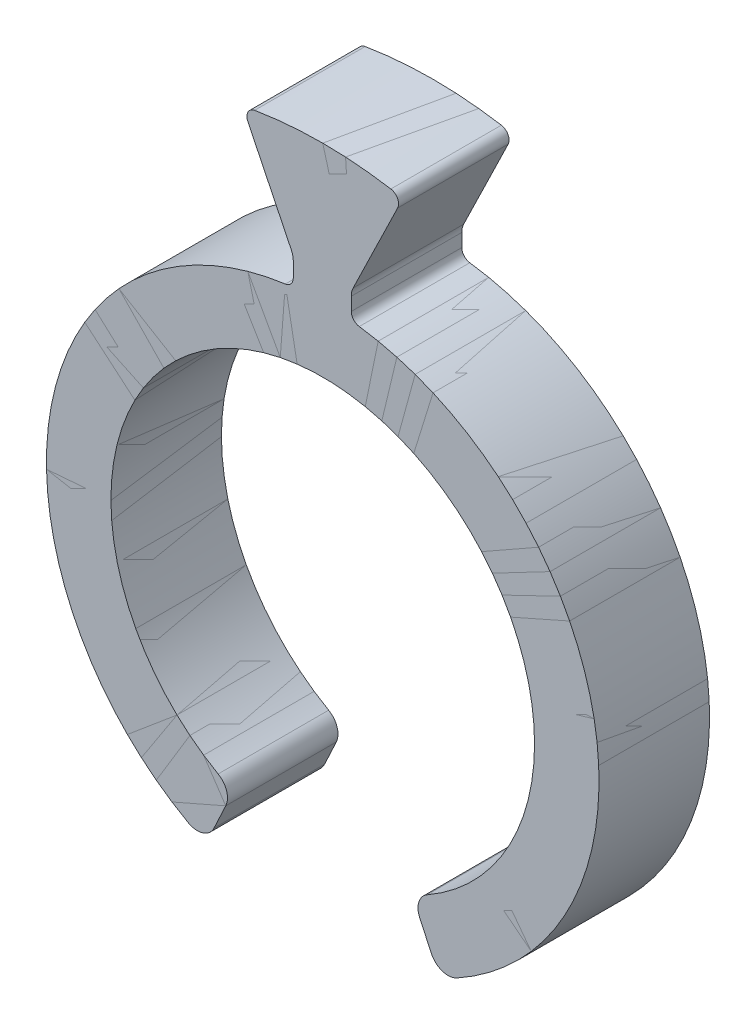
ISO-10303-21;
HEADER;
FILE_DESCRIPTION(('STEP AP214'),'2;1');
FILE_NAME('part.step','',(''),(''),'','','');
FILE_SCHEMA(('AUTOMOTIVE_DESIGN { 1 0 10303 214 1 1 1 1 }'));
ENDSEC;
DATA;
#1=APPLICATION_CONTEXT('core data for automotive mechanical design processes');
#2=APPLICATION_PROTOCOL_DEFINITION('international standard','automotive_design',2000,#1);
#3=PRODUCT_CONTEXT('',#1,'mechanical');
#4=PRODUCT('Part','Part','',(#3));
#5=PRODUCT_RELATED_PRODUCT_CATEGORY('part','',(#4));
#6=PRODUCT_DEFINITION_FORMATION('','',#4);
#7=PRODUCT_DEFINITION_CONTEXT('part definition',#1,'design');
#8=PRODUCT_DEFINITION('design','',#6,#7);
#9=PRODUCT_DEFINITION_SHAPE('','',#8);
#10=(LENGTH_UNIT() NAMED_UNIT(*) SI_UNIT(.MILLI.,.METRE.));
#11=(NAMED_UNIT(*) PLANE_ANGLE_UNIT() SI_UNIT($,.RADIAN.));
#12=(NAMED_UNIT(*) SI_UNIT($,.STERADIAN.) SOLID_ANGLE_UNIT());
#13=UNCERTAINTY_MEASURE_WITH_UNIT(LENGTH_MEASURE(1.E-05),#10,'distance_accuracy_value','');
#14=(GEOMETRIC_REPRESENTATION_CONTEXT(3) GLOBAL_UNCERTAINTY_ASSIGNED_CONTEXT((#13)) GLOBAL_UNIT_ASSIGNED_CONTEXT((#10,
#11,#12)) REPRESENTATION_CONTEXT('',''));
#15=CARTESIAN_POINT('',(0.,0.,0.));
#16=DIRECTION('',(0.,0.,1.));
#17=DIRECTION('',(1.,0.,0.));
#18=AXIS2_PLACEMENT_3D('',#15,#16,#17);
#19=CARTESIAN_POINT('',(8.83337144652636,-6.81471511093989,-3.));
#20=DIRECTION('',(0.,0.,-1.));
#21=DIRECTION('',(-1.,0.,0.));
#22=AXIS2_PLACEMENT_3D('',#19,#20,#21);
#23=PLANE('',#22);
#24=DIRECTION('',(0.43721847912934,0.899355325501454,0.));
#25=VECTOR('',#24,1.);
#26=CARTESIAN_POINT('',(1.48098888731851,9.60596693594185,-3.));
#27=LINE('',#26,#25);
#28=CARTESIAN_POINT('',(0.825161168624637,8.25693394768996,-3.));
#29=VERTEX_POINT('',#28);
#30=CARTESIAN_POINT('',(2.03282757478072,10.7410952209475,-3.));
#31=VERTEX_POINT('',#30);
#32=EDGE_CURVE('P0_E491',#29,#31,#27,.T.);
#33=ORIENTED_EDGE('',*,*,#32,.F.);
#34=CARTESIAN_POINT('',(1.2748388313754,8.0383247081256,-3.));
#35=DIRECTION('',(0.,0.,-1.));
#36=DIRECTION('',(-1.,0.,0.));
#37=AXIS2_PLACEMENT_3D('',#34,#35,#36);
#38=CIRCLE('',#37,0.500000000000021);
#39=CARTESIAN_POINT('',(0.774838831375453,8.03832470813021,-3.));
#40=VERTEX_POINT('',#39);
#41=EDGE_CURVE('P0_E354',#40,#29,#38,.T.);
#42=ORIENTED_EDGE('',*,*,#41,.F.);
#43=DIRECTION('',(1.83866593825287E-11,1.,0.));
#44=VECTOR('',#43,1.);
#45=CARTESIAN_POINT('',(0.77483883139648,9.1819402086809,-3.));
#46=LINE('',#45,#44);
#47=CARTESIAN_POINT('',(0.7748388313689,7.6819402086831,-3.));
#48=VERTEX_POINT('',#47);
#49=EDGE_CURVE('P0_E489',#48,#40,#46,.T.);
#50=ORIENTED_EDGE('',*,*,#49,.F.);
#51=CARTESIAN_POINT('',(1.0248388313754,7.6819402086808,-3.));
#52=DIRECTION('',(0.,0.,-1.));
#53=DIRECTION('',(-1.,0.,0.));
#54=AXIS2_PLACEMENT_3D('',#51,#52,#53);
#55=CIRCLE('',#54,0.250000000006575);
#56=CARTESIAN_POINT('',(0.991779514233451,7.43413568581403,-3.));
#57=VERTEX_POINT('',#56);
#58=EDGE_CURVE('P0_E504',#57,#48,#55,.T.);
#59=ORIENTED_EDGE('',*,*,#58,.F.);
#60=CARTESIAN_POINT('',(0.,0.,-3.));
#61=DIRECTION('',(0.,0.,1.));
#62=DIRECTION('',(1.,0.,0.));
#63=AXIS2_PLACEMENT_3D('',#60,#61,#62);
#64=CIRCLE('',#63,7.49999999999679);
#65=CARTESIAN_POINT('',(3.64706284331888,-6.55354351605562,-3.));
#66=VERTEX_POINT('',#65);
#67=EDGE_CURVE('P0_E582',#57,#66,#64,.F.);
#68=ORIENTED_EDGE('',*,*,#67,.T.);
#69=CARTESIAN_POINT('',(3.4039253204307,-6.1166406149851,-3.));
#70=DIRECTION('',(0.,0.,1.));
#71=DIRECTION('',(1.,0.,0.));
#72=AXIS2_PLACEMENT_3D('',#69,#70,#71);
#73=CIRCLE('',#72,0.500000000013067);
#74=CARTESIAN_POINT('',(2.95077142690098,-6.32794974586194,-3.));
#75=VERTEX_POINT('',#74);
#76=EDGE_CURVE('P0_E512',#66,#75,#73,.F.);
#77=ORIENTED_EDGE('',*,*,#76,.T.);
#78=DIRECTION('',(0.422618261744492,-0.906307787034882,0.));
#79=VECTOR('',#78,1.);
#80=CARTESIAN_POINT('',(3.26682559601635,-7.00573009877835,-3.));
#81=LINE('',#80,#79);
#82=CARTESIAN_POINT('',(2.63289820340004,-5.64626841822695,-3.));
#83=VERTEX_POINT('',#82);
#84=EDGE_CURVE('P0_E509',#83,#75,#81,.T.);
#85=ORIENTED_EDGE('',*,*,#84,.F.);
#86=CARTESIAN_POINT('',(3.0860520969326,-5.4349592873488,-3.));
#87=DIRECTION('',(0.,0.,1.));
#88=DIRECTION('',(1.,0.,0.));
#89=AXIS2_PLACEMENT_3D('',#86,#87,#88);
#90=CIRCLE('',#89,0.50000000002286);
#91=CARTESIAN_POINT('',(2.83916792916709,-5.00016254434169,-3.));
#92=VERTEX_POINT('',#91);
#93=EDGE_CURVE('P0_E587',#83,#92,#90,.F.);
#94=ORIENTED_EDGE('',*,*,#93,.T.);
#95=CARTESIAN_POINT('',(0.,0.,-3.));
#96=DIRECTION('',(0.,0.,-1.));
#97=DIRECTION('',(-1.,0.,0.));
#98=AXIS2_PLACEMENT_3D('',#95,#96,#97);
#99=CIRCLE('',#98,5.7499999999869);
#100=CARTESIAN_POINT('',(-2.83916792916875,-5.00016254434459,-3.));
#101=VERTEX_POINT('',#100);
#102=EDGE_CURVE('P0_E590',#101,#92,#99,.T.);
#103=ORIENTED_EDGE('',*,*,#102,.F.);
#104=CARTESIAN_POINT('',(-3.0860520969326,-5.4349592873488,-3.));
#105=DIRECTION('',(0.,0.,1.));
#106=DIRECTION('',(1.,0.,0.));
#107=AXIS2_PLACEMENT_3D('',#104,#105,#106);
#108=CIRCLE('',#107,0.50000000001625);
#109=CARTESIAN_POINT('',(-2.6328982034,-5.64626841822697,-3.));
#110=VERTEX_POINT('',#109);
#111=EDGE_CURVE('P0_E517',#101,#110,#108,.F.);
#112=ORIENTED_EDGE('',*,*,#111,.T.);
#113=DIRECTION('',(0.422618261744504,0.906307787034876,0.));
#114=VECTOR('',#113,1.);
#115=CARTESIAN_POINT('',(-2.31684403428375,-4.9684880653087,-3.));
#116=LINE('',#115,#114);
#117=CARTESIAN_POINT('',(-2.95077142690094,-6.32794974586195,-3.));
#118=VERTEX_POINT('',#117);
#119=EDGE_CURVE('P0_E514',#118,#110,#116,.T.);
#120=ORIENTED_EDGE('',*,*,#119,.F.);
#121=CARTESIAN_POINT('',(-3.4039253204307,-6.1166406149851,-3.));
#122=DIRECTION('',(0.,0.,1.));
#123=DIRECTION('',(1.,0.,0.));
#124=AXIS2_PLACEMENT_3D('',#121,#122,#123);
#125=CIRCLE('',#124,0.500000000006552);
#126=CARTESIAN_POINT('',(-3.6470628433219,-6.55354351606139,-3.));
#127=VERTEX_POINT('',#126);
#128=EDGE_CURVE('P0_E596',#118,#127,#125,.F.);
#129=ORIENTED_EDGE('',*,*,#128,.T.);
#130=CARTESIAN_POINT('',(0.,0.,-3.));
#131=DIRECTION('',(0.,0.,1.));
#132=DIRECTION('',(1.,0.,0.));
#133=AXIS2_PLACEMENT_3D('',#130,#131,#132);
#134=CIRCLE('',#133,7.49999999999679);
#135=CARTESIAN_POINT('',(-1.01612903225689,7.43084664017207,-3.));
#136=VERTEX_POINT('',#135);
#137=EDGE_CURVE('P0_E600',#127,#136,#134,.F.);
#138=ORIENTED_EDGE('',*,*,#137,.T.);
#139=CARTESIAN_POINT('',(-1.0499999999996,7.6785415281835,-3.));
#140=DIRECTION('',(0.,0.,-1.));
#141=DIRECTION('',(-1.,0.,0.));
#142=AXIS2_PLACEMENT_3D('',#139,#140,#141);
#143=CIRCLE('',#142,0.250000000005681);
#144=CARTESIAN_POINT('',(-0.799999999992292,7.67854152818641,-3.));
#145=VERTEX_POINT('',#144);
#146=EDGE_CURVE('P0_E602',#145,#136,#143,.T.);
#147=ORIENTED_EDGE('',*,*,#146,.F.);
#148=DIRECTION('',(2.24633318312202E-11,-1.,0.));
#149=VECTOR('',#148,1.);
#150=CARTESIAN_POINT('',(-0.799999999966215,6.5900810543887,-3.));
#151=LINE('',#150,#149);
#152=CARTESIAN_POINT('',(-0.79999999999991,8.09008105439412,-3.));
#153=VERTEX_POINT('',#152);
#154=EDGE_CURVE('P0_E519',#153,#145,#151,.T.);
#155=ORIENTED_EDGE('',*,*,#154,.F.);
#156=CARTESIAN_POINT('',(-1.2999999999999,8.0900810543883,-3.));
#157=DIRECTION('',(0.,0.,-1.));
#158=DIRECTION('',(-1.,0.,0.));
#159=AXIS2_PLACEMENT_3D('',#156,#157,#158);
#160=CIRCLE('',#159,0.499999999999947);
#161=CARTESIAN_POINT('',(-0.850322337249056,8.30869029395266,-3.));
#162=VERTEX_POINT('',#161);
#163=EDGE_CURVE('P0_E605',#162,#153,#160,.T.);
#164=ORIENTED_EDGE('',*,*,#163,.F.);
#165=DIRECTION('',(0.437218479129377,-0.899355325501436,0.));
#166=VECTOR('',#165,1.);
#167=CARTESIAN_POINT('',(-1.37699985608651,9.392062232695,-3.));
#168=LINE('',#167,#166);
#169=CARTESIAN_POINT('',(-2.03282757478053,10.7410952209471,-3.));
#170=VERTEX_POINT('',#169);
#171=EDGE_CURVE('P0_E523',#170,#162,#168,.T.);
#172=ORIENTED_EDGE('',*,*,#171,.F.);
#173=CARTESIAN_POINT('',(-1.8079887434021,10.850399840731,-3.));
#174=DIRECTION('',(0.,0.,1.));
#175=DIRECTION('',(1.,0.,0.));
#176=AXIS2_PLACEMENT_3D('',#173,#174,#175);
#177=CIRCLE('',#176,0.250000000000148);
#178=CARTESIAN_POINT('',(-1.84907939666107,11.0969998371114,-3.));
#179=VERTEX_POINT('',#178);
#180=EDGE_CURVE('P0_E607',#170,#179,#177,.F.);
#181=ORIENTED_EDGE('',*,*,#180,.T.);
#182=CARTESIAN_POINT('',(0.,0.,-3.));
#183=DIRECTION('',(0.,0.,1.));
#184=DIRECTION('',(1.,0.,0.));
#185=AXIS2_PLACEMENT_3D('',#182,#183,#184);
#186=CIRCLE('',#185,11.25);
#187=CARTESIAN_POINT('',(1.84907875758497,11.0969999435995,-3.));
#188=VERTEX_POINT('',#187);
#189=EDGE_CURVE('P0_E611',#179,#188,#186,.F.);
#190=ORIENTED_EDGE('',*,*,#189,.T.);
#191=CARTESIAN_POINT('',(1.8079887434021,10.850399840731,-3.));
#192=DIRECTION('',(0.,0.,1.));
#193=DIRECTION('',(1.,0.,0.));
#194=AXIS2_PLACEMENT_3D('',#191,#192,#193);
#195=CIRCLE('',#194,0.250000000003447);
#196=EDGE_CURVE('P0_E528',#188,#31,#195,.F.);
#197=ORIENTED_EDGE('',*,*,#196,.T.);
#198=EDGE_LOOP('',(#33,#42,#50,#59,#68,#77,#85,#94,#103,#112,#120,#129,#138,#147,#155,#164,#172,
#181,#190,#197));
#199=FACE_BOUND('',#198,.T.);
#200=ADVANCED_FACE('P0_F350',(#199),#23,.T.);
#201=CARTESIAN_POINT('',(1.2748388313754,8.0383247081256,0.));
#202=DIRECTION('',(0.,0.,-1.));
#203=DIRECTION('',(-1.,0.,0.));
#204=AXIS2_PLACEMENT_3D('',#201,#202,#203);
#205=CYLINDRICAL_SURFACE('',#204,0.500000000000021);
#206=ORIENTED_EDGE('',*,*,#41,.T.);
#207=DIRECTION('',(0.,0.,-1.));
#208=VECTOR('',#207,1.);
#209=CARTESIAN_POINT('',(0.82516116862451,8.2569339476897,-1.5));
#210=LINE('',#209,#208);
#211=CARTESIAN_POINT('',(0.825161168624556,8.25693394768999,0.));
#212=VERTEX_POINT('',#211);
#213=EDGE_CURVE('P0_E494',#212,#29,#210,.T.);
#214=ORIENTED_EDGE('',*,*,#213,.F.);
#215=CARTESIAN_POINT('',(1.2748388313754,8.0383247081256,0.));
#216=DIRECTION('',(0.,0.,-1.));
#217=DIRECTION('',(-1.,0.,0.));
#218=AXIS2_PLACEMENT_3D('',#215,#216,#217);
#219=CIRCLE('',#218,0.500000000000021);
#220=CARTESIAN_POINT('',(0.774838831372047,8.03832470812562,0.));
#221=VERTEX_POINT('',#220);
#222=EDGE_CURVE('P0_E499',#221,#212,#219,.T.);
#223=ORIENTED_EDGE('',*,*,#222,.F.);
#224=DIRECTION('',(0.,0.,1.));
#225=VECTOR('',#224,1.);
#226=CARTESIAN_POINT('',(0.774838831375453,8.03832470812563,-1.5));
#227=LINE('',#226,#225);
#228=EDGE_CURVE('P0_E496',#40,#221,#227,.T.);
#229=ORIENTED_EDGE('',*,*,#228,.F.);
#230=EDGE_LOOP('',(#206,#214,#223,#229));
#231=FACE_BOUND('',#230,.T.);
#232=ADVANCED_FACE('P0_F497',(#231),#205,.F.);
#233=CARTESIAN_POINT('',(0.82516116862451,8.2569339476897,0.));
#234=DIRECTION('',(0.899355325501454,-0.43721847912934,0.));
#235=DIRECTION('',(0.,0.,-1.));
#236=AXIS2_PLACEMENT_3D('',#233,#234,#235);
#237=PLANE('',#236);
#238=ORIENTED_EDGE('',*,*,#32,.T.);
#239=DIRECTION('',(0.,0.,1.));
#240=VECTOR('',#239,1.);
#241=CARTESIAN_POINT('',(2.03282757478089,10.7410952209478,-1.5));
#242=LINE('',#241,#240);
#243=CARTESIAN_POINT('',(2.03282757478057,10.7410952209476,0.));
#244=VERTEX_POINT('',#243);
#245=EDGE_CURVE('P0_E612',#31,#244,#242,.T.);
#246=ORIENTED_EDGE('',*,*,#245,.T.);
#247=DIRECTION('',(0.437218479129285,0.899355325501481,0.));
#248=VECTOR('',#247,1.);
#249=CARTESIAN_POINT('',(0.825161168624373,8.2569339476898,0.));
#250=LINE('',#249,#248);
#251=EDGE_CURVE('P0_E576',#212,#244,#250,.T.);
#252=ORIENTED_EDGE('',*,*,#251,.F.);
#253=ORIENTED_EDGE('',*,*,#213,.T.);
#254=EDGE_LOOP('',(#238,#246,#252,#253));
#255=FACE_BOUND('',#254,.T.);
#256=ADVANCED_FACE('P0_F694',(#255),#237,.T.);
#257=CARTESIAN_POINT('',(1.8079887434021,10.850399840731,-3.));
#258=DIRECTION('',(0.,0.,1.));
#259=DIRECTION('',(1.,0.,0.));
#260=AXIS2_PLACEMENT_3D('',#257,#258,#259);
#261=CYLINDRICAL_SURFACE('',#260,0.250000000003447);
#262=ORIENTED_EDGE('',*,*,#245,.F.);
#263=ORIENTED_EDGE('',*,*,#196,.F.);
#264=DIRECTION('',(0.,0.,1.));
#265=VECTOR('',#264,1.);
#266=CARTESIAN_POINT('',(1.84907811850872,11.097000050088,-1.5));
#267=LINE('',#266,#265);
#268=CARTESIAN_POINT('',(1.84907875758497,11.0969999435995,0.));
#269=VERTEX_POINT('',#268);
#270=EDGE_CURVE('P0_E610',#188,#269,#267,.T.);
#271=ORIENTED_EDGE('',*,*,#270,.T.);
#272=CARTESIAN_POINT('',(1.8079887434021,10.850399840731,0.));
#273=DIRECTION('',(0.,0.,1.));
#274=DIRECTION('',(1.,0.,0.));
#275=AXIS2_PLACEMENT_3D('',#272,#273,#274);
#276=CIRCLE('',#275,0.250000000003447);
#277=EDGE_CURVE('P0_E573',#244,#269,#276,.T.);
#278=ORIENTED_EDGE('',*,*,#277,.F.);
#279=EDGE_LOOP('',(#262,#263,#271,#278));
#280=FACE_BOUND('',#279,.T.);
#281=ADVANCED_FACE('P0_F696',(#280),#261,.T.);
#282=CARTESIAN_POINT('',(0.,0.,-3.));
#283=DIRECTION('',(0.,0.,1.));
#284=DIRECTION('',(1.,0.,0.));
#285=AXIS2_PLACEMENT_3D('',#282,#283,#284);
#286=CYLINDRICAL_SURFACE('',#285,11.25);
#287=ORIENTED_EDGE('',*,*,#270,.F.);
#288=ORIENTED_EDGE('',*,*,#189,.F.);
#289=DIRECTION('',(0.,0.,1.));
#290=VECTOR('',#289,1.);
#291=CARTESIAN_POINT('',(-1.84907939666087,11.0969998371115,-1.5));
#292=LINE('',#291,#290);
#293=CARTESIAN_POINT('',(-1.84907939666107,11.0969998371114,0.));
#294=VERTEX_POINT('',#293);
#295=EDGE_CURVE('P0_E609',#179,#294,#292,.T.);
#296=ORIENTED_EDGE('',*,*,#295,.T.);
#297=CARTESIAN_POINT('',(0.,0.,0.));
#298=DIRECTION('',(0.,0.,1.));
#299=DIRECTION('',(1.,0.,0.));
#300=AXIS2_PLACEMENT_3D('',#297,#298,#299);
#301=CIRCLE('',#300,11.25);
#302=EDGE_CURVE('P0_E570',#269,#294,#301,.T.);
#303=ORIENTED_EDGE('',*,*,#302,.F.);
#304=EDGE_LOOP('',(#287,#288,#296,#303));
#305=FACE_BOUND('',#304,.T.);
#306=ADVANCED_FACE('P0_F701',(#305),#286,.T.);
#307=CARTESIAN_POINT('',(-1.8079887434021,10.850399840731,-3.));
#308=DIRECTION('',(0.,0.,1.));
#309=DIRECTION('',(1.,0.,0.));
#310=AXIS2_PLACEMENT_3D('',#307,#308,#309);
#311=CYLINDRICAL_SURFACE('',#310,0.250000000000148);
#312=ORIENTED_EDGE('',*,*,#295,.F.);
#313=ORIENTED_EDGE('',*,*,#180,.F.);
#314=DIRECTION('',(0.,0.,-1.));
#315=VECTOR('',#314,1.);
#316=CARTESIAN_POINT('',(-2.0328275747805,10.741095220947,-1.5));
#317=LINE('',#316,#315);
#318=CARTESIAN_POINT('',(-2.03282757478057,10.7410952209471,0.));
#319=VERTEX_POINT('',#318);
#320=EDGE_CURVE('P0_E526',#319,#170,#317,.T.);
#321=ORIENTED_EDGE('',*,*,#320,.F.);
#322=CARTESIAN_POINT('',(-1.8079887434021,10.850399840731,0.));
#323=DIRECTION('',(0.,0.,1.));
#324=DIRECTION('',(1.,0.,0.));
#325=AXIS2_PLACEMENT_3D('',#322,#323,#324);
#326=CIRCLE('',#325,0.250000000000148);
#327=EDGE_CURVE('P0_E567',#294,#319,#326,.T.);
#328=ORIENTED_EDGE('',*,*,#327,.F.);
#329=EDGE_LOOP('',(#312,#313,#321,#328));
#330=FACE_BOUND('',#329,.T.);
#331=ADVANCED_FACE('P0_F706',(#330),#311,.T.);
#332=CARTESIAN_POINT('',(-2.0328275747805,10.741095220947,0.));
#333=DIRECTION('',(-0.899355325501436,-0.437218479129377,0.));
#334=DIRECTION('',(0.,0.,-1.));
#335=AXIS2_PLACEMENT_3D('',#332,#333,#334);
#336=PLANE('',#335);
#337=ORIENTED_EDGE('',*,*,#171,.T.);
#338=DIRECTION('',(0.,0.,-1.));
#339=VECTOR('',#338,1.);
#340=CARTESIAN_POINT('',(-0.850322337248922,8.30869029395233,-1.5));
#341=LINE('',#340,#339);
#342=CARTESIAN_POINT('',(-0.850322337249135,8.30869029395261,0.));
#343=VERTEX_POINT('',#342);
#344=EDGE_CURVE('P0_E525',#343,#162,#341,.T.);
#345=ORIENTED_EDGE('',*,*,#344,.F.);
#346=DIRECTION('',(0.437218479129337,-0.899355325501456,0.));
#347=VECTOR('',#346,1.);
#348=CARTESIAN_POINT('',(-2.03282757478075,10.7410952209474,0.));
#349=LINE('',#348,#347);
#350=EDGE_CURVE('P0_E564',#319,#343,#349,.T.);
#351=ORIENTED_EDGE('',*,*,#350,.F.);
#352=ORIENTED_EDGE('',*,*,#320,.T.);
#353=EDGE_LOOP('',(#337,#345,#351,#352));
#354=FACE_BOUND('',#353,.T.);
#355=ADVANCED_FACE('P0_F709',(#354),#336,.T.);
#356=CARTESIAN_POINT('',(-1.2999999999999,8.0900810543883,0.));
#357=DIRECTION('',(0.,0.,-1.));
#358=DIRECTION('',(-1.,0.,0.));
#359=AXIS2_PLACEMENT_3D('',#356,#357,#358);
#360=CYLINDRICAL_SURFACE('',#359,0.499999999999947);
#361=ORIENTED_EDGE('',*,*,#163,.T.);
#362=DIRECTION('',(0.,0.,-1.));
#363=VECTOR('',#362,1.);
#364=CARTESIAN_POINT('',(-0.79999999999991,8.0900810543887,-1.5));
#365=LINE('',#364,#363);
#366=CARTESIAN_POINT('',(-0.799999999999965,8.0900810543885,0.));
#367=VERTEX_POINT('',#366);
#368=EDGE_CURVE('P0_E522',#367,#153,#365,.T.);
#369=ORIENTED_EDGE('',*,*,#368,.F.);
#370=CARTESIAN_POINT('',(-1.2999999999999,8.0900810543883,0.));
#371=DIRECTION('',(0.,0.,-1.));
#372=DIRECTION('',(-1.,0.,0.));
#373=AXIS2_PLACEMENT_3D('',#370,#371,#372);
#374=CIRCLE('',#373,0.499999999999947);
#375=EDGE_CURVE('P0_E561',#343,#367,#374,.T.);
#376=ORIENTED_EDGE('',*,*,#375,.F.);
#377=ORIENTED_EDGE('',*,*,#344,.T.);
#378=EDGE_LOOP('',(#361,#369,#376,#377));
#379=FACE_BOUND('',#378,.T.);
#380=ADVANCED_FACE('P0_F712',(#379),#360,.F.);
#381=CARTESIAN_POINT('',(-0.79999999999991,8.0900810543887,0.));
#382=DIRECTION('',(-1.,-2.24633318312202E-11,0.));
#383=DIRECTION('',(0.,0.,-1.));
#384=AXIS2_PLACEMENT_3D('',#381,#382,#383);
#385=PLANE('',#384);
#386=ORIENTED_EDGE('',*,*,#154,.T.);
#387=DIRECTION('',(0.,0.,-1.));
#388=VECTOR('',#387,1.);
#389=CARTESIAN_POINT('',(-0.799999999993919,7.67854152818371,-1.5));
#390=LINE('',#389,#388);
#391=CARTESIAN_POINT('',(-0.79999999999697,7.67854152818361,0.));
#392=VERTEX_POINT('',#391);
#393=EDGE_CURVE('P0_E521',#392,#145,#390,.T.);
#394=ORIENTED_EDGE('',*,*,#393,.F.);
#395=DIRECTION('',(0.,-1.,0.));
#396=VECTOR('',#395,1.);
#397=CARTESIAN_POINT('',(-0.80000000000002,2.30697564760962,0.));
#398=LINE('',#397,#396);
#399=EDGE_CURVE('P0_E560',#367,#392,#398,.T.);
#400=ORIENTED_EDGE('',*,*,#399,.F.);
#401=ORIENTED_EDGE('',*,*,#368,.T.);
#402=EDGE_LOOP('',(#386,#394,#400,#401));
#403=FACE_BOUND('',#402,.T.);
#404=ADVANCED_FACE('P0_F649',(#403),#385,.T.);
#405=CARTESIAN_POINT('',(-1.0499999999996,7.6785415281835,0.));
#406=DIRECTION('',(0.,0.,-1.));
#407=DIRECTION('',(-1.,0.,0.));
#408=AXIS2_PLACEMENT_3D('',#405,#406,#407);
#409=CYLINDRICAL_SURFACE('',#408,0.250000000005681);
#410=ORIENTED_EDGE('',*,*,#146,.T.);
#411=DIRECTION('',(0.,0.,1.));
#412=VECTOR('',#411,1.);
#413=CARTESIAN_POINT('',(-1.01612903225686,7.43084664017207,-1.5));
#414=LINE('',#413,#412);
#415=CARTESIAN_POINT('',(-1.01612903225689,7.43084664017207,0.));
#416=VERTEX_POINT('',#415);
#417=EDGE_CURVE('P0_E599',#136,#416,#414,.T.);
#418=ORIENTED_EDGE('',*,*,#417,.T.);
#419=CARTESIAN_POINT('',(-1.0499999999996,7.6785415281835,0.));
#420=DIRECTION('',(0.,0.,-1.));
#421=DIRECTION('',(-1.,0.,0.));
#422=AXIS2_PLACEMENT_3D('',#419,#420,#421);
#423=CIRCLE('',#422,0.250000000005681);
#424=EDGE_CURVE('P0_E557',#392,#416,#423,.T.);
#425=ORIENTED_EDGE('',*,*,#424,.F.);
#426=ORIENTED_EDGE('',*,*,#393,.T.);
#427=EDGE_LOOP('',(#410,#418,#425,#426));
#428=FACE_BOUND('',#427,.T.);
#429=ADVANCED_FACE('P0_F653',(#428),#409,.F.);
#430=CARTESIAN_POINT('',(0.,0.,-3.));
#431=DIRECTION('',(0.,0.,1.));
#432=DIRECTION('',(1.,0.,0.));
#433=AXIS2_PLACEMENT_3D('',#430,#431,#432);
#434=CYLINDRICAL_SURFACE('',#433,7.49999999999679);
#435=ORIENTED_EDGE('',*,*,#417,.F.);
#436=ORIENTED_EDGE('',*,*,#137,.F.);
#437=DIRECTION('',(0.,0.,1.));
#438=VECTOR('',#437,1.);
#439=CARTESIAN_POINT('',(-3.6470628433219,-6.5535435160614,-1.5));
#440=LINE('',#439,#438);
#441=CARTESIAN_POINT('',(-3.6470628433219,-6.55354351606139,0.));
#442=VERTEX_POINT('',#441);
#443=EDGE_CURVE('P0_E598',#127,#442,#440,.T.);
#444=ORIENTED_EDGE('',*,*,#443,.T.);
#445=CARTESIAN_POINT('',(0.,0.,0.));
#446=DIRECTION('',(0.,0.,1.));
#447=DIRECTION('',(1.,0.,0.));
#448=AXIS2_PLACEMENT_3D('',#445,#446,#447);
#449=CIRCLE('',#448,7.49999999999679);
#450=EDGE_CURVE('P0_E554',#416,#442,#449,.T.);
#451=ORIENTED_EDGE('',*,*,#450,.F.);
#452=EDGE_LOOP('',(#435,#436,#444,#451));
#453=FACE_BOUND('',#452,.T.);
#454=ADVANCED_FACE('P0_F658',(#453),#434,.T.);
#455=CARTESIAN_POINT('',(-3.4039253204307,-6.1166406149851,-3.));
#456=DIRECTION('',(0.,0.,1.));
#457=DIRECTION('',(1.,0.,0.));
#458=AXIS2_PLACEMENT_3D('',#455,#456,#457);
#459=CYLINDRICAL_SURFACE('',#458,0.500000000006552);
#460=ORIENTED_EDGE('',*,*,#443,.F.);
#461=ORIENTED_EDGE('',*,*,#128,.F.);
#462=DIRECTION('',(0.,0.,-1.));
#463=VECTOR('',#462,1.);
#464=CARTESIAN_POINT('',(-2.9507714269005,-6.327949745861,-1.5));
#465=LINE('',#464,#463);
#466=CARTESIAN_POINT('',(-2.95077142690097,-6.32794974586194,0.));
#467=VERTEX_POINT('',#466);
#468=EDGE_CURVE('P0_E518',#467,#118,#465,.T.);
#469=ORIENTED_EDGE('',*,*,#468,.F.);
#470=CARTESIAN_POINT('',(-3.4039253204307,-6.1166406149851,0.));
#471=DIRECTION('',(0.,0.,1.));
#472=DIRECTION('',(1.,0.,0.));
#473=AXIS2_PLACEMENT_3D('',#470,#471,#472);
#474=CIRCLE('',#473,0.500000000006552);
#475=EDGE_CURVE('P0_E551',#442,#467,#474,.T.);
#476=ORIENTED_EDGE('',*,*,#475,.F.);
#477=EDGE_LOOP('',(#460,#461,#469,#476));
#478=FACE_BOUND('',#477,.T.);
#479=ADVANCED_FACE('P0_F663',(#478),#459,.T.);
#480=CARTESIAN_POINT('',(-2.9507714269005,-6.327949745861,0.));
#481=DIRECTION('',(0.906307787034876,-0.422618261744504,0.));
#482=DIRECTION('',(0.,0.,-1.));
#483=AXIS2_PLACEMENT_3D('',#480,#481,#482);
#484=PLANE('',#483);
#485=ORIENTED_EDGE('',*,*,#119,.T.);
#486=DIRECTION('',(0.,0.,1.));
#487=VECTOR('',#486,1.);
#488=CARTESIAN_POINT('',(-2.63289820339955,-5.64626841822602,-1.5));
#489=LINE('',#488,#487);
#490=CARTESIAN_POINT('',(-2.63289820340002,-5.64626841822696,0.));
#491=VERTEX_POINT('',#490);
#492=EDGE_CURVE('P0_E595',#110,#491,#489,.T.);
#493=ORIENTED_EDGE('',*,*,#492,.T.);
#494=DIRECTION('',(0.422618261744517,0.90630778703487,0.));
#495=VECTOR('',#494,1.);
#496=CARTESIAN_POINT('',(-2.9507714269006,-6.32794974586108,0.));
#497=LINE('',#496,#495);
#498=EDGE_CURVE('P0_E548',#467,#491,#497,.T.);
#499=ORIENTED_EDGE('',*,*,#498,.F.);
#500=ORIENTED_EDGE('',*,*,#468,.T.);
#501=EDGE_LOOP('',(#485,#493,#499,#500));
#502=FACE_BOUND('',#501,.T.);
#503=ADVANCED_FACE('P0_F666',(#502),#484,.T.);
#504=CARTESIAN_POINT('',(-3.0860520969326,-5.4349592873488,-3.));
#505=DIRECTION('',(0.,0.,1.));
#506=DIRECTION('',(1.,0.,0.));
#507=AXIS2_PLACEMENT_3D('',#504,#505,#506);
#508=CYLINDRICAL_SURFACE('',#507,0.50000000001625);
#509=ORIENTED_EDGE('',*,*,#492,.F.);
#510=ORIENTED_EDGE('',*,*,#111,.F.);
#511=DIRECTION('',(0.,0.,-1.));
#512=VECTOR('',#511,1.);
#513=CARTESIAN_POINT('',(-2.83916792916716,-5.00016254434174,-1.5));
#514=LINE('',#513,#512);
#515=CARTESIAN_POINT('',(-2.83916792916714,-5.00016254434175,0.));
#516=VERTEX_POINT('',#515);
#517=EDGE_CURVE('P0_E593',#516,#101,#514,.T.);
#518=ORIENTED_EDGE('',*,*,#517,.F.);
#519=CARTESIAN_POINT('',(-3.0860520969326,-5.4349592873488,0.));
#520=DIRECTION('',(0.,0.,1.));
#521=DIRECTION('',(1.,0.,0.));
#522=AXIS2_PLACEMENT_3D('',#519,#520,#521);
#523=CIRCLE('',#522,0.50000000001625);
#524=EDGE_CURVE('P0_E545',#491,#516,#523,.T.);
#525=ORIENTED_EDGE('',*,*,#524,.F.);
#526=EDGE_LOOP('',(#509,#510,#518,#525));
#527=FACE_BOUND('',#526,.T.);
#528=ADVANCED_FACE('P0_F670',(#527),#508,.T.);
#529=CARTESIAN_POINT('',(0.,0.,0.));
#530=DIRECTION('',(0.,0.,-1.));
#531=DIRECTION('',(-1.,0.,0.));
#532=AXIS2_PLACEMENT_3D('',#529,#530,#531);
#533=CYLINDRICAL_SURFACE('',#532,5.7499999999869);
#534=ORIENTED_EDGE('',*,*,#102,.T.);
#535=DIRECTION('',(0.,0.,1.));
#536=VECTOR('',#535,1.);
#537=CARTESIAN_POINT('',(2.83916792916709,-5.00016254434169,-1.5));
#538=LINE('',#537,#536);
#539=CARTESIAN_POINT('',(2.83916792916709,-5.00016254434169,0.));
#540=VERTEX_POINT('',#539);
#541=EDGE_CURVE('P0_E589',#92,#540,#538,.T.);
#542=ORIENTED_EDGE('',*,*,#541,.T.);
#543=CARTESIAN_POINT('',(0.,0.,0.));
#544=DIRECTION('',(0.,0.,-1.));
#545=DIRECTION('',(-1.,0.,0.));
#546=AXIS2_PLACEMENT_3D('',#543,#544,#545);
#547=CIRCLE('',#546,5.7499999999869);
#548=EDGE_CURVE('P0_E542',#516,#540,#547,.T.);
#549=ORIENTED_EDGE('',*,*,#548,.F.);
#550=ORIENTED_EDGE('',*,*,#517,.T.);
#551=EDGE_LOOP('',(#534,#542,#549,#550));
#552=FACE_BOUND('',#551,.T.);
#553=ADVANCED_FACE('P0_F674',(#552),#533,.F.);
#554=CARTESIAN_POINT('',(3.0860520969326,-5.4349592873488,-3.));
#555=DIRECTION('',(0.,0.,1.));
#556=DIRECTION('',(1.,0.,0.));
#557=AXIS2_PLACEMENT_3D('',#554,#555,#556);
#558=CYLINDRICAL_SURFACE('',#557,0.50000000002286);
#559=ORIENTED_EDGE('',*,*,#541,.F.);
#560=ORIENTED_EDGE('',*,*,#93,.F.);
#561=DIRECTION('',(0.,0.,-1.));
#562=VECTOR('',#561,1.);
#563=CARTESIAN_POINT('',(2.6328982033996,-5.646268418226,-1.5));
#564=LINE('',#563,#562);
#565=CARTESIAN_POINT('',(2.63289820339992,-5.64626841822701,0.));
#566=VERTEX_POINT('',#565);
#567=EDGE_CURVE('P0_E513',#566,#83,#564,.T.);
#568=ORIENTED_EDGE('',*,*,#567,.F.);
#569=CARTESIAN_POINT('',(3.0860520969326,-5.4349592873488,0.));
#570=DIRECTION('',(0.,0.,1.));
#571=DIRECTION('',(1.,0.,0.));
#572=AXIS2_PLACEMENT_3D('',#569,#570,#571);
#573=CIRCLE('',#572,0.50000000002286);
#574=EDGE_CURVE('P0_E539',#540,#566,#573,.T.);
#575=ORIENTED_EDGE('',*,*,#574,.F.);
#576=EDGE_LOOP('',(#559,#560,#568,#575));
#577=FACE_BOUND('',#576,.T.);
#578=ADVANCED_FACE('P0_F678',(#577),#558,.T.);
#579=CARTESIAN_POINT('',(2.6328982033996,-5.646268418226,0.));
#580=DIRECTION('',(-0.906307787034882,-0.422618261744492,0.));
#581=DIRECTION('',(0.,0.,-1.));
#582=AXIS2_PLACEMENT_3D('',#579,#580,#581);
#583=PLANE('',#582);
#584=ORIENTED_EDGE('',*,*,#84,.T.);
#585=DIRECTION('',(0.,0.,1.));
#586=VECTOR('',#585,1.);
#587=CARTESIAN_POINT('',(2.95077142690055,-6.327949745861,-1.5));
#588=LINE('',#587,#586);
#589=CARTESIAN_POINT('',(2.95077142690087,-6.32794974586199,0.));
#590=VERTEX_POINT('',#589);
#591=EDGE_CURVE('P0_E586',#75,#590,#588,.T.);
#592=ORIENTED_EDGE('',*,*,#591,.T.);
#593=DIRECTION('',(0.422618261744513,-0.906307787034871,0.));
#594=VECTOR('',#593,1.);
#595=CARTESIAN_POINT('',(2.63289820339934,-5.64626841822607,0.));
#596=LINE('',#595,#594);
#597=EDGE_CURVE('P0_E536',#566,#590,#596,.T.);
#598=ORIENTED_EDGE('',*,*,#597,.F.);
#599=ORIENTED_EDGE('',*,*,#567,.T.);
#600=EDGE_LOOP('',(#584,#592,#598,#599));
#601=FACE_BOUND('',#600,.T.);
#602=ADVANCED_FACE('P0_F682',(#601),#583,.T.);
#603=CARTESIAN_POINT('',(3.4039253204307,-6.1166406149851,-3.));
#604=DIRECTION('',(0.,0.,1.));
#605=DIRECTION('',(1.,0.,0.));
#606=AXIS2_PLACEMENT_3D('',#603,#604,#605);
#607=CYLINDRICAL_SURFACE('',#606,0.500000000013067);
#608=ORIENTED_EDGE('',*,*,#591,.F.);
#609=ORIENTED_EDGE('',*,*,#76,.F.);
#610=DIRECTION('',(0.,0.,1.));
#611=VECTOR('',#610,1.);
#612=CARTESIAN_POINT('',(3.64706284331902,-6.55354351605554,-1.5));
#613=LINE('',#612,#611);
#614=CARTESIAN_POINT('',(3.64706284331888,-6.55354351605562,0.));
#615=VERTEX_POINT('',#614);
#616=EDGE_CURVE('P0_E584',#66,#615,#613,.T.);
#617=ORIENTED_EDGE('',*,*,#616,.T.);
#618=CARTESIAN_POINT('',(3.4039253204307,-6.1166406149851,0.));
#619=DIRECTION('',(0.,0.,1.));
#620=DIRECTION('',(1.,0.,0.));
#621=AXIS2_PLACEMENT_3D('',#618,#619,#620);
#622=CIRCLE('',#621,0.500000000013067);
#623=EDGE_CURVE('P0_E533',#590,#615,#622,.T.);
#624=ORIENTED_EDGE('',*,*,#623,.F.);
#625=EDGE_LOOP('',(#608,#609,#617,#624));
#626=FACE_BOUND('',#625,.T.);
#627=ADVANCED_FACE('P0_F688',(#626),#607,.T.);
#628=CARTESIAN_POINT('',(0.,0.,-3.));
#629=DIRECTION('',(0.,0.,1.));
#630=DIRECTION('',(1.,0.,0.));
#631=AXIS2_PLACEMENT_3D('',#628,#629,#630);
#632=CYLINDRICAL_SURFACE('',#631,7.49999999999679);
#633=DIRECTION('',(0.,0.,-1.));
#634=VECTOR('',#633,1.);
#635=CARTESIAN_POINT('',(0.991779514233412,7.43413568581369,-1.5));
#636=LINE('',#635,#634);
#637=CARTESIAN_POINT('',(0.991779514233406,7.4341356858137,0.));
#638=VERTEX_POINT('',#637);
#639=EDGE_CURVE('P0_E581',#638,#57,#636,.T.);
#640=ORIENTED_EDGE('',*,*,#639,.F.);
#641=CARTESIAN_POINT('',(0.,0.,0.));
#642=DIRECTION('',(0.,0.,1.));
#643=DIRECTION('',(1.,0.,0.));
#644=AXIS2_PLACEMENT_3D('',#641,#642,#643);
#645=CIRCLE('',#644,7.49999999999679);
#646=EDGE_CURVE('P0_E531',#615,#638,#645,.T.);
#647=ORIENTED_EDGE('',*,*,#646,.F.);
#648=ORIENTED_EDGE('',*,*,#616,.F.);
#649=ORIENTED_EDGE('',*,*,#67,.F.);
#650=EDGE_LOOP('',(#640,#647,#648,#649));
#651=FACE_BOUND('',#650,.T.);
#652=ADVANCED_FACE('P0_F692',(#651),#632,.T.);
#653=CARTESIAN_POINT('',(1.0248388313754,7.6819402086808,0.));
#654=DIRECTION('',(0.,0.,-1.));
#655=DIRECTION('',(-1.,0.,0.));
#656=AXIS2_PLACEMENT_3D('',#653,#654,#655);
#657=CYLINDRICAL_SURFACE('',#656,0.250000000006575);
#658=ORIENTED_EDGE('',*,*,#58,.T.);
#659=DIRECTION('',(0.,0.,-1.));
#660=VECTOR('',#659,1.);
#661=CARTESIAN_POINT('',(0.7748388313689,7.6819402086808,-1.5));
#662=LINE('',#661,#660);
#663=CARTESIAN_POINT('',(0.774838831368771,7.6819402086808,0.));
#664=VERTEX_POINT('',#663);
#665=EDGE_CURVE('P0_E369',#664,#48,#662,.T.);
#666=ORIENTED_EDGE('',*,*,#665,.F.);
#667=CARTESIAN_POINT('',(1.0248388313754,7.6819402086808,0.));
#668=DIRECTION('',(0.,0.,-1.));
#669=DIRECTION('',(-1.,0.,0.));
#670=AXIS2_PLACEMENT_3D('',#667,#668,#669);
#671=CIRCLE('',#670,0.250000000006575);
#672=EDGE_CURVE('P0_E360',#638,#664,#671,.T.);
#673=ORIENTED_EDGE('',*,*,#672,.F.);
#674=ORIENTED_EDGE('',*,*,#639,.T.);
#675=EDGE_LOOP('',(#658,#666,#673,#674));
#676=FACE_BOUND('',#675,.T.);
#677=ADVANCED_FACE('P0_F693',(#676),#657,.F.);
#678=CARTESIAN_POINT('',(0.7748388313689,7.6819402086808,0.));
#679=DIRECTION('',(1.,-1.83866593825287E-11,0.));
#680=DIRECTION('',(0.,0.,-1.));
#681=AXIS2_PLACEMENT_3D('',#678,#679,#680);
#682=PLANE('',#681);
#683=ORIENTED_EDGE('',*,*,#49,.T.);
#684=ORIENTED_EDGE('',*,*,#228,.T.);
#685=DIRECTION('',(0.,1.,0.));
#686=VECTOR('',#685,1.);
#687=CARTESIAN_POINT('',(0.774838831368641,2.30697564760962,0.));
#688=LINE('',#687,#686);
#689=EDGE_CURVE('P0_E11',#664,#221,#688,.T.);
#690=ORIENTED_EDGE('',*,*,#689,.F.);
#691=ORIENTED_EDGE('',*,*,#665,.T.);
#692=EDGE_LOOP('',(#683,#684,#690,#691));
#693=FACE_BOUND('',#692,.T.);
#694=ADVANCED_FACE('P0_F502',(#693),#682,.T.);
#695=CARTESIAN_POINT('',(-23.3004058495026,-6.81471511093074,0.));
#696=DIRECTION('',(0.,0.,1.));
#697=DIRECTION('',(1.,0.,0.));
#698=AXIS2_PLACEMENT_3D('',#695,#696,#697);
#699=PLANE('',#698);
#700=ORIENTED_EDGE('',*,*,#672,.T.);
#701=ORIENTED_EDGE('',*,*,#689,.T.);
#702=ORIENTED_EDGE('',*,*,#222,.T.);
#703=ORIENTED_EDGE('',*,*,#251,.T.);
#704=ORIENTED_EDGE('',*,*,#277,.T.);
#705=ORIENTED_EDGE('',*,*,#302,.T.);
#706=ORIENTED_EDGE('',*,*,#327,.T.);
#707=ORIENTED_EDGE('',*,*,#350,.T.);
#708=ORIENTED_EDGE('',*,*,#375,.T.);
#709=ORIENTED_EDGE('',*,*,#399,.T.);
#710=ORIENTED_EDGE('',*,*,#424,.T.);
#711=ORIENTED_EDGE('',*,*,#450,.T.);
#712=ORIENTED_EDGE('',*,*,#475,.T.);
#713=ORIENTED_EDGE('',*,*,#498,.T.);
#714=ORIENTED_EDGE('',*,*,#524,.T.);
#715=ORIENTED_EDGE('',*,*,#548,.T.);
#716=ORIENTED_EDGE('',*,*,#574,.T.);
#717=ORIENTED_EDGE('',*,*,#597,.T.);
#718=ORIENTED_EDGE('',*,*,#623,.T.);
#719=ORIENTED_EDGE('',*,*,#646,.T.);
#720=EDGE_LOOP('',(#700,#701,#702,#703,#704,#705,#706,#707,#708,#709,#710,#711,#712,#713,#714,
#715,#716,#717,#718,#719));
#721=FACE_BOUND('',#720,.T.);
#722=ADVANCED_FACE('P0_F352',(#721),#699,.T.);
#723=CLOSED_SHELL('',(#200,#232,#256,#281,#306,#331,#355,#380,#404,#429,#454,#479,#503,#528,
#553,#578,#602,#627,#652,#677,#694,#722));
#724=MANIFOLD_SOLID_BREP('P0_B2',#723);
#725=CARTESIAN_POINT('',(8.83337144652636,-6.81471511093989,-3.));
#726=DIRECTION('',(0.,0.,-1.));
#727=DIRECTION('',(-1.,0.,0.));
#728=AXIS2_PLACEMENT_3D('',#725,#726,#727);
#729=PLANE('',#728);
#730=DIRECTION('',(0.43721847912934,0.899355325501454,0.));
#731=VECTOR('',#730,1.);
#732=CARTESIAN_POINT('',(1.48098888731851,9.60596693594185,-3.));
#733=LINE('',#732,#731);
#734=CARTESIAN_POINT('',(0.825161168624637,8.25693394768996,-3.));
#735=VERTEX_POINT('',#734);
#736=CARTESIAN_POINT('',(2.03282757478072,10.7410952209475,-3.));
#737=VERTEX_POINT('',#736);
#738=EDGE_CURVE('P1_E157',#735,#737,#733,.T.);
#739=ORIENTED_EDGE('',*,*,#738,.F.);
#740=CARTESIAN_POINT('',(1.2748388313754,8.0383247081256,-3.));
#741=DIRECTION('',(0.,0.,-1.));
#742=DIRECTION('',(-1.,0.,0.));
#743=AXIS2_PLACEMENT_3D('',#740,#741,#742);
#744=CIRCLE('',#743,0.500000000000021);
#745=CARTESIAN_POINT('',(0.774838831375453,8.03832470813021,-3.));
#746=VERTEX_POINT('',#745);
#747=EDGE_CURVE('P1_E20',#746,#735,#744,.T.);
#748=ORIENTED_EDGE('',*,*,#747,.F.);
#749=DIRECTION('',(1.83866593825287E-11,1.,0.));
#750=VECTOR('',#749,1.);
#751=CARTESIAN_POINT('',(0.77483883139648,9.1819402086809,-3.));
#752=LINE('',#751,#750);
#753=CARTESIAN_POINT('',(0.7748388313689,7.6819402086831,-3.));
#754=VERTEX_POINT('',#753);
#755=EDGE_CURVE('P1_E155',#754,#746,#752,.T.);
#756=ORIENTED_EDGE('',*,*,#755,.F.);
#757=CARTESIAN_POINT('',(1.0248388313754,7.6819402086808,-3.));
#758=DIRECTION('',(0.,0.,-1.));
#759=DIRECTION('',(-1.,0.,0.));
#760=AXIS2_PLACEMENT_3D('',#757,#758,#759);
#761=CIRCLE('',#760,0.250000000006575);
#762=CARTESIAN_POINT('',(0.991779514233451,7.43413568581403,-3.));
#763=VERTEX_POINT('',#762);
#764=EDGE_CURVE('P1_E170',#763,#754,#761,.T.);
#765=ORIENTED_EDGE('',*,*,#764,.F.);
#766=CARTESIAN_POINT('',(0.,0.,-3.));
#767=DIRECTION('',(0.,0.,1.));
#768=DIRECTION('',(1.,0.,0.));
#769=AXIS2_PLACEMENT_3D('',#766,#767,#768);
#770=CIRCLE('',#769,7.49999999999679);
#771=CARTESIAN_POINT('',(3.64706284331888,-6.55354351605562,-3.));
#772=VERTEX_POINT('',#771);
#773=EDGE_CURVE('P1_E248',#763,#772,#770,.F.);
#774=ORIENTED_EDGE('',*,*,#773,.T.);
#775=CARTESIAN_POINT('',(3.4039253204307,-6.1166406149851,-3.));
#776=DIRECTION('',(0.,0.,1.));
#777=DIRECTION('',(1.,0.,0.));
#778=AXIS2_PLACEMENT_3D('',#775,#776,#777);
#779=CIRCLE('',#778,0.500000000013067);
#780=CARTESIAN_POINT('',(2.95077142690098,-6.32794974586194,-3.));
#781=VERTEX_POINT('',#780);
#782=EDGE_CURVE('P1_E178',#772,#781,#779,.F.);
#783=ORIENTED_EDGE('',*,*,#782,.T.);
#784=DIRECTION('',(0.422618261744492,-0.906307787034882,0.));
#785=VECTOR('',#784,1.);
#786=CARTESIAN_POINT('',(3.26682559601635,-7.00573009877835,-3.));
#787=LINE('',#786,#785);
#788=CARTESIAN_POINT('',(2.63289820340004,-5.64626841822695,-3.));
#789=VERTEX_POINT('',#788);
#790=EDGE_CURVE('P1_E175',#789,#781,#787,.T.);
#791=ORIENTED_EDGE('',*,*,#790,.F.);
#792=CARTESIAN_POINT('',(3.0860520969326,-5.4349592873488,-3.));
#793=DIRECTION('',(0.,0.,1.));
#794=DIRECTION('',(1.,0.,0.));
#795=AXIS2_PLACEMENT_3D('',#792,#793,#794);
#796=CIRCLE('',#795,0.50000000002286);
#797=CARTESIAN_POINT('',(2.83916792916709,-5.00016254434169,-3.));
#798=VERTEX_POINT('',#797);
#799=EDGE_CURVE('P1_E253',#789,#798,#796,.F.);
#800=ORIENTED_EDGE('',*,*,#799,.T.);
#801=CARTESIAN_POINT('',(0.,0.,-3.));
#802=DIRECTION('',(0.,0.,-1.));
#803=DIRECTION('',(-1.,0.,0.));
#804=AXIS2_PLACEMENT_3D('',#801,#802,#803);
#805=CIRCLE('',#804,5.7499999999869);
#806=CARTESIAN_POINT('',(-2.83916792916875,-5.00016254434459,-3.));
#807=VERTEX_POINT('',#806);
#808=EDGE_CURVE('P1_E256',#807,#798,#805,.T.);
#809=ORIENTED_EDGE('',*,*,#808,.F.);
#810=CARTESIAN_POINT('',(-3.0860520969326,-5.4349592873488,-3.));
#811=DIRECTION('',(0.,0.,1.));
#812=DIRECTION('',(1.,0.,0.));
#813=AXIS2_PLACEMENT_3D('',#810,#811,#812);
#814=CIRCLE('',#813,0.50000000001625);
#815=CARTESIAN_POINT('',(-2.6328982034,-5.64626841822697,-3.));
#816=VERTEX_POINT('',#815);
#817=EDGE_CURVE('P1_E183',#807,#816,#814,.F.);
#818=ORIENTED_EDGE('',*,*,#817,.T.);
#819=DIRECTION('',(0.422618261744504,0.906307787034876,0.));
#820=VECTOR('',#819,1.);
#821=CARTESIAN_POINT('',(-2.31684403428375,-4.9684880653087,-3.));
#822=LINE('',#821,#820);
#823=CARTESIAN_POINT('',(-2.95077142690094,-6.32794974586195,-3.));
#824=VERTEX_POINT('',#823);
#825=EDGE_CURVE('P1_E180',#824,#816,#822,.T.);
#826=ORIENTED_EDGE('',*,*,#825,.F.);
#827=CARTESIAN_POINT('',(-3.4039253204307,-6.1166406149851,-3.));
#828=DIRECTION('',(0.,0.,1.));
#829=DIRECTION('',(1.,0.,0.));
#830=AXIS2_PLACEMENT_3D('',#827,#828,#829);
#831=CIRCLE('',#830,0.500000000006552);
#832=CARTESIAN_POINT('',(-3.6470628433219,-6.55354351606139,-3.));
#833=VERTEX_POINT('',#832);
#834=EDGE_CURVE('P1_E262',#824,#833,#831,.F.);
#835=ORIENTED_EDGE('',*,*,#834,.T.);
#836=CARTESIAN_POINT('',(0.,0.,-3.));
#837=DIRECTION('',(0.,0.,1.));
#838=DIRECTION('',(1.,0.,0.));
#839=AXIS2_PLACEMENT_3D('',#836,#837,#838);
#840=CIRCLE('',#839,7.49999999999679);
#841=CARTESIAN_POINT('',(-1.01612903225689,7.43084664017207,-3.));
#842=VERTEX_POINT('',#841);
#843=EDGE_CURVE('P1_E266',#833,#842,#840,.F.);
#844=ORIENTED_EDGE('',*,*,#843,.T.);
#845=CARTESIAN_POINT('',(-1.0499999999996,7.6785415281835,-3.));
#846=DIRECTION('',(0.,0.,-1.));
#847=DIRECTION('',(-1.,0.,0.));
#848=AXIS2_PLACEMENT_3D('',#845,#846,#847);
#849=CIRCLE('',#848,0.250000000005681);
#850=CARTESIAN_POINT('',(-0.799999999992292,7.67854152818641,-3.));
#851=VERTEX_POINT('',#850);
#852=EDGE_CURVE('P1_E268',#851,#842,#849,.T.);
#853=ORIENTED_EDGE('',*,*,#852,.F.);
#854=DIRECTION('',(2.24633318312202E-11,-1.,0.));
#855=VECTOR('',#854,1.);
#856=CARTESIAN_POINT('',(-0.799999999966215,6.5900810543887,-3.));
#857=LINE('',#856,#855);
#858=CARTESIAN_POINT('',(-0.79999999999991,8.09008105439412,-3.));
#859=VERTEX_POINT('',#858);
#860=EDGE_CURVE('P1_E185',#859,#851,#857,.T.);
#861=ORIENTED_EDGE('',*,*,#860,.F.);
#862=CARTESIAN_POINT('',(-1.2999999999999,8.0900810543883,-3.));
#863=DIRECTION('',(0.,0.,-1.));
#864=DIRECTION('',(-1.,0.,0.));
#865=AXIS2_PLACEMENT_3D('',#862,#863,#864);
#866=CIRCLE('',#865,0.499999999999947);
#867=CARTESIAN_POINT('',(-0.850322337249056,8.30869029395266,-3.));
#868=VERTEX_POINT('',#867);
#869=EDGE_CURVE('P1_E271',#868,#859,#866,.T.);
#870=ORIENTED_EDGE('',*,*,#869,.F.);
#871=DIRECTION('',(0.437218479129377,-0.899355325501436,0.));
#872=VECTOR('',#871,1.);
#873=CARTESIAN_POINT('',(-1.37699985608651,9.392062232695,-3.));
#874=LINE('',#873,#872);
#875=CARTESIAN_POINT('',(-2.03282757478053,10.7410952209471,-3.));
#876=VERTEX_POINT('',#875);
#877=EDGE_CURVE('P1_E189',#876,#868,#874,.T.);
#878=ORIENTED_EDGE('',*,*,#877,.F.);
#879=CARTESIAN_POINT('',(-1.8079887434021,10.850399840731,-3.));
#880=DIRECTION('',(0.,0.,1.));
#881=DIRECTION('',(1.,0.,0.));
#882=AXIS2_PLACEMENT_3D('',#879,#880,#881);
#883=CIRCLE('',#882,0.250000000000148);
#884=CARTESIAN_POINT('',(-1.84907939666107,11.0969998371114,-3.));
#885=VERTEX_POINT('',#884);
#886=EDGE_CURVE('P1_E273',#876,#885,#883,.F.);
#887=ORIENTED_EDGE('',*,*,#886,.T.);
#888=CARTESIAN_POINT('',(0.,0.,-3.));
#889=DIRECTION('',(0.,0.,1.));
#890=DIRECTION('',(1.,0.,0.));
#891=AXIS2_PLACEMENT_3D('',#888,#889,#890);
#892=CIRCLE('',#891,11.25);
#893=CARTESIAN_POINT('',(1.84907875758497,11.0969999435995,-3.));
#894=VERTEX_POINT('',#893);
#895=EDGE_CURVE('P1_E277',#885,#894,#892,.F.);
#896=ORIENTED_EDGE('',*,*,#895,.T.);
#897=CARTESIAN_POINT('',(1.8079887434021,10.850399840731,-3.));
#898=DIRECTION('',(0.,0.,1.));
#899=DIRECTION('',(1.,0.,0.));
#900=AXIS2_PLACEMENT_3D('',#897,#898,#899);
#901=CIRCLE('',#900,0.250000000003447);
#902=EDGE_CURVE('P1_E194',#894,#737,#901,.F.);
#903=ORIENTED_EDGE('',*,*,#902,.T.);
#904=EDGE_LOOP('',(#739,#748,#756,#765,#774,#783,#791,#800,#809,#818,#826,#835,#844,#853,#861,
#870,#878,#887,#896,#903));
#905=FACE_BOUND('',#904,.T.);
#906=ADVANCED_FACE('P1_F16',(#905),#729,.T.);
#907=CARTESIAN_POINT('',(1.2748388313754,8.0383247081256,0.));
#908=DIRECTION('',(0.,0.,-1.));
#909=DIRECTION('',(-1.,0.,0.));
#910=AXIS2_PLACEMENT_3D('',#907,#908,#909);
#911=CYLINDRICAL_SURFACE('',#910,0.500000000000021);
#912=ORIENTED_EDGE('',*,*,#747,.T.);
#913=DIRECTION('',(0.,0.,-1.));
#914=VECTOR('',#913,1.);
#915=CARTESIAN_POINT('',(0.82516116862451,8.2569339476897,-1.5));
#916=LINE('',#915,#914);
#917=CARTESIAN_POINT('',(0.825161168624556,8.25693394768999,0.));
#918=VERTEX_POINT('',#917);
#919=EDGE_CURVE('P1_E160',#918,#735,#916,.T.);
#920=ORIENTED_EDGE('',*,*,#919,.F.);
#921=CARTESIAN_POINT('',(1.2748388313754,8.0383247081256,0.));
#922=DIRECTION('',(0.,0.,-1.));
#923=DIRECTION('',(-1.,0.,0.));
#924=AXIS2_PLACEMENT_3D('',#921,#922,#923);
#925=CIRCLE('',#924,0.500000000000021);
#926=CARTESIAN_POINT('',(0.774838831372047,8.03832470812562,0.));
#927=VERTEX_POINT('',#926);
#928=EDGE_CURVE('P1_E165',#927,#918,#925,.T.);
#929=ORIENTED_EDGE('',*,*,#928,.F.);
#930=DIRECTION('',(0.,0.,1.));
#931=VECTOR('',#930,1.);
#932=CARTESIAN_POINT('',(0.774838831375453,8.03832470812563,-1.5));
#933=LINE('',#932,#931);
#934=EDGE_CURVE('P1_E162',#746,#927,#933,.T.);
#935=ORIENTED_EDGE('',*,*,#934,.F.);
#936=EDGE_LOOP('',(#912,#920,#929,#935));
#937=FACE_BOUND('',#936,.T.);
#938=ADVANCED_FACE('P1_F163',(#937),#911,.F.);
#939=CARTESIAN_POINT('',(0.82516116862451,8.2569339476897,0.));
#940=DIRECTION('',(0.899355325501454,-0.43721847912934,0.));
#941=DIRECTION('',(0.,0.,-1.));
#942=AXIS2_PLACEMENT_3D('',#939,#940,#941);
#943=PLANE('',#942);
#944=ORIENTED_EDGE('',*,*,#738,.T.);
#945=DIRECTION('',(0.,0.,1.));
#946=VECTOR('',#945,1.);
#947=CARTESIAN_POINT('',(2.03282757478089,10.7410952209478,-1.5));
#948=LINE('',#947,#946);
#949=CARTESIAN_POINT('',(2.03282757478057,10.7410952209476,0.));
#950=VERTEX_POINT('',#949);
#951=EDGE_CURVE('P1_E278',#737,#950,#948,.T.);
#952=ORIENTED_EDGE('',*,*,#951,.T.);
#953=DIRECTION('',(0.437218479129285,0.899355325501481,0.));
#954=VECTOR('',#953,1.);
#955=CARTESIAN_POINT('',(0.825161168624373,8.2569339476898,0.));
#956=LINE('',#955,#954);
#957=EDGE_CURVE('P1_E242',#918,#950,#956,.T.);
#958=ORIENTED_EDGE('',*,*,#957,.F.);
#959=ORIENTED_EDGE('',*,*,#919,.T.);
#960=EDGE_LOOP('',(#944,#952,#958,#959));
#961=FACE_BOUND('',#960,.T.);
#962=ADVANCED_FACE('P1_F360',(#961),#943,.T.);
#963=CARTESIAN_POINT('',(1.8079887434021,10.850399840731,-3.));
#964=DIRECTION('',(0.,0.,1.));
#965=DIRECTION('',(1.,0.,0.));
#966=AXIS2_PLACEMENT_3D('',#963,#964,#965);
#967=CYLINDRICAL_SURFACE('',#966,0.250000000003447);
#968=ORIENTED_EDGE('',*,*,#951,.F.);
#969=ORIENTED_EDGE('',*,*,#902,.F.);
#970=DIRECTION('',(0.,0.,1.));
#971=VECTOR('',#970,1.);
#972=CARTESIAN_POINT('',(1.84907811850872,11.097000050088,-1.5));
#973=LINE('',#972,#971);
#974=CARTESIAN_POINT('',(1.84907875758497,11.0969999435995,0.));
#975=VERTEX_POINT('',#974);
#976=EDGE_CURVE('P1_E276',#894,#975,#973,.T.);
#977=ORIENTED_EDGE('',*,*,#976,.T.);
#978=CARTESIAN_POINT('',(1.8079887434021,10.850399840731,0.));
#979=DIRECTION('',(0.,0.,1.));
#980=DIRECTION('',(1.,0.,0.));
#981=AXIS2_PLACEMENT_3D('',#978,#979,#980);
#982=CIRCLE('',#981,0.250000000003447);
#983=EDGE_CURVE('P1_E239',#950,#975,#982,.T.);
#984=ORIENTED_EDGE('',*,*,#983,.F.);
#985=EDGE_LOOP('',(#968,#969,#977,#984));
#986=FACE_BOUND('',#985,.T.);
#987=ADVANCED_FACE('P1_F362',(#986),#967,.T.);
#988=CARTESIAN_POINT('',(0.,0.,-3.));
#989=DIRECTION('',(0.,0.,1.));
#990=DIRECTION('',(1.,0.,0.));
#991=AXIS2_PLACEMENT_3D('',#988,#989,#990);
#992=CYLINDRICAL_SURFACE('',#991,11.25);
#993=ORIENTED_EDGE('',*,*,#976,.F.);
#994=ORIENTED_EDGE('',*,*,#895,.F.);
#995=DIRECTION('',(0.,0.,1.));
#996=VECTOR('',#995,1.);
#997=CARTESIAN_POINT('',(-1.84907939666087,11.0969998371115,-1.5));
#998=LINE('',#997,#996);
#999=CARTESIAN_POINT('',(-1.84907939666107,11.0969998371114,0.));
#1000=VERTEX_POINT('',#999);
#1001=EDGE_CURVE('P1_E275',#885,#1000,#998,.T.);
#1002=ORIENTED_EDGE('',*,*,#1001,.T.);
#1003=CARTESIAN_POINT('',(0.,0.,0.));
#1004=DIRECTION('',(0.,0.,1.));
#1005=DIRECTION('',(1.,0.,0.));
#1006=AXIS2_PLACEMENT_3D('',#1003,#1004,#1005);
#1007=CIRCLE('',#1006,11.25);
#1008=EDGE_CURVE('P1_E236',#975,#1000,#1007,.T.);
#1009=ORIENTED_EDGE('',*,*,#1008,.F.);
#1010=EDGE_LOOP('',(#993,#994,#1002,#1009));
#1011=FACE_BOUND('',#1010,.T.);
#1012=ADVANCED_FACE('P1_F367',(#1011),#992,.T.);
#1013=CARTESIAN_POINT('',(-1.8079887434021,10.850399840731,-3.));
#1014=DIRECTION('',(0.,0.,1.));
#1015=DIRECTION('',(1.,0.,0.));
#1016=AXIS2_PLACEMENT_3D('',#1013,#1014,#1015);
#1017=CYLINDRICAL_SURFACE('',#1016,0.250000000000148);
#1018=ORIENTED_EDGE('',*,*,#1001,.F.);
#1019=ORIENTED_EDGE('',*,*,#886,.F.);
#1020=DIRECTION('',(0.,0.,-1.));
#1021=VECTOR('',#1020,1.);
#1022=CARTESIAN_POINT('',(-2.0328275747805,10.741095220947,-1.5));
#1023=LINE('',#1022,#1021);
#1024=CARTESIAN_POINT('',(-2.03282757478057,10.7410952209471,0.));
#1025=VERTEX_POINT('',#1024);
#1026=EDGE_CURVE('P1_E192',#1025,#876,#1023,.T.);
#1027=ORIENTED_EDGE('',*,*,#1026,.F.);
#1028=CARTESIAN_POINT('',(-1.8079887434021,10.850399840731,0.));
#1029=DIRECTION('',(0.,0.,1.));
#1030=DIRECTION('',(1.,0.,0.));
#1031=AXIS2_PLACEMENT_3D('',#1028,#1029,#1030);
#1032=CIRCLE('',#1031,0.250000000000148);
#1033=EDGE_CURVE('P1_E233',#1000,#1025,#1032,.T.);
#1034=ORIENTED_EDGE('',*,*,#1033,.F.);
#1035=EDGE_LOOP('',(#1018,#1019,#1027,#1034));
#1036=FACE_BOUND('',#1035,.T.);
#1037=ADVANCED_FACE('P1_F372',(#1036),#1017,.T.);
#1038=CARTESIAN_POINT('',(-2.0328275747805,10.741095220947,0.));
#1039=DIRECTION('',(-0.899355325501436,-0.437218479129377,0.));
#1040=DIRECTION('',(0.,0.,-1.));
#1041=AXIS2_PLACEMENT_3D('',#1038,#1039,#1040);
#1042=PLANE('',#1041);
#1043=ORIENTED_EDGE('',*,*,#877,.T.);
#1044=DIRECTION('',(0.,0.,-1.));
#1045=VECTOR('',#1044,1.);
#1046=CARTESIAN_POINT('',(-0.850322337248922,8.30869029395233,-1.5));
#1047=LINE('',#1046,#1045);
#1048=CARTESIAN_POINT('',(-0.850322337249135,8.30869029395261,0.));
#1049=VERTEX_POINT('',#1048);
#1050=EDGE_CURVE('P1_E191',#1049,#868,#1047,.T.);
#1051=ORIENTED_EDGE('',*,*,#1050,.F.);
#1052=DIRECTION('',(0.437218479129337,-0.899355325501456,0.));
#1053=VECTOR('',#1052,1.);
#1054=CARTESIAN_POINT('',(-2.03282757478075,10.7410952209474,0.));
#1055=LINE('',#1054,#1053);
#1056=EDGE_CURVE('P1_E230',#1025,#1049,#1055,.T.);
#1057=ORIENTED_EDGE('',*,*,#1056,.F.);
#1058=ORIENTED_EDGE('',*,*,#1026,.T.);
#1059=EDGE_LOOP('',(#1043,#1051,#1057,#1058));
#1060=FACE_BOUND('',#1059,.T.);
#1061=ADVANCED_FACE('P1_F375',(#1060),#1042,.T.);
#1062=CARTESIAN_POINT('',(-1.2999999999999,8.0900810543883,0.));
#1063=DIRECTION('',(0.,0.,-1.));
#1064=DIRECTION('',(-1.,0.,0.));
#1065=AXIS2_PLACEMENT_3D('',#1062,#1063,#1064);
#1066=CYLINDRICAL_SURFACE('',#1065,0.499999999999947);
#1067=ORIENTED_EDGE('',*,*,#869,.T.);
#1068=DIRECTION('',(0.,0.,-1.));
#1069=VECTOR('',#1068,1.);
#1070=CARTESIAN_POINT('',(-0.79999999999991,8.0900810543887,-1.5));
#1071=LINE('',#1070,#1069);
#1072=CARTESIAN_POINT('',(-0.799999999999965,8.0900810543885,0.));
#1073=VERTEX_POINT('',#1072);
#1074=EDGE_CURVE('P1_E188',#1073,#859,#1071,.T.);
#1075=ORIENTED_EDGE('',*,*,#1074,.F.);
#1076=CARTESIAN_POINT('',(-1.2999999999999,8.0900810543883,0.));
#1077=DIRECTION('',(0.,0.,-1.));
#1078=DIRECTION('',(-1.,0.,0.));
#1079=AXIS2_PLACEMENT_3D('',#1076,#1077,#1078);
#1080=CIRCLE('',#1079,0.499999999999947);
#1081=EDGE_CURVE('P1_E227',#1049,#1073,#1080,.T.);
#1082=ORIENTED_EDGE('',*,*,#1081,.F.);
#1083=ORIENTED_EDGE('',*,*,#1050,.T.);
#1084=EDGE_LOOP('',(#1067,#1075,#1082,#1083));
#1085=FACE_BOUND('',#1084,.T.);
#1086=ADVANCED_FACE('P1_F378',(#1085),#1066,.F.);
#1087=CARTESIAN_POINT('',(-0.79999999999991,8.0900810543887,0.));
#1088=DIRECTION('',(-1.,-2.24633318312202E-11,0.));
#1089=DIRECTION('',(0.,0.,-1.));
#1090=AXIS2_PLACEMENT_3D('',#1087,#1088,#1089);
#1091=PLANE('',#1090);
#1092=ORIENTED_EDGE('',*,*,#860,.T.);
#1093=DIRECTION('',(0.,0.,-1.));
#1094=VECTOR('',#1093,1.);
#1095=CARTESIAN_POINT('',(-0.799999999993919,7.67854152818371,-1.5));
#1096=LINE('',#1095,#1094);
#1097=CARTESIAN_POINT('',(-0.79999999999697,7.67854152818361,0.));
#1098=VERTEX_POINT('',#1097);
#1099=EDGE_CURVE('P1_E187',#1098,#851,#1096,.T.);
#1100=ORIENTED_EDGE('',*,*,#1099,.F.);
#1101=DIRECTION('',(0.,-1.,0.));
#1102=VECTOR('',#1101,1.);
#1103=CARTESIAN_POINT('',(-0.80000000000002,2.30697564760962,0.));
#1104=LINE('',#1103,#1102);
#1105=EDGE_CURVE('P1_E226',#1073,#1098,#1104,.T.);
#1106=ORIENTED_EDGE('',*,*,#1105,.F.);
#1107=ORIENTED_EDGE('',*,*,#1074,.T.);
#1108=EDGE_LOOP('',(#1092,#1100,#1106,#1107));
#1109=FACE_BOUND('',#1108,.T.);
#1110=ADVANCED_FACE('P1_F315',(#1109),#1091,.T.);
#1111=CARTESIAN_POINT('',(-1.0499999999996,7.6785415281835,0.));
#1112=DIRECTION('',(0.,0.,-1.));
#1113=DIRECTION('',(-1.,0.,0.));
#1114=AXIS2_PLACEMENT_3D('',#1111,#1112,#1113);
#1115=CYLINDRICAL_SURFACE('',#1114,0.250000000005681);
#1116=ORIENTED_EDGE('',*,*,#852,.T.);
#1117=DIRECTION('',(0.,0.,1.));
#1118=VECTOR('',#1117,1.);
#1119=CARTESIAN_POINT('',(-1.01612903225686,7.43084664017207,-1.5));
#1120=LINE('',#1119,#1118);
#1121=CARTESIAN_POINT('',(-1.01612903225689,7.43084664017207,0.));
#1122=VERTEX_POINT('',#1121);
#1123=EDGE_CURVE('P1_E265',#842,#1122,#1120,.T.);
#1124=ORIENTED_EDGE('',*,*,#1123,.T.);
#1125=CARTESIAN_POINT('',(-1.0499999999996,7.6785415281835,0.));
#1126=DIRECTION('',(0.,0.,-1.));
#1127=DIRECTION('',(-1.,0.,0.));
#1128=AXIS2_PLACEMENT_3D('',#1125,#1126,#1127);
#1129=CIRCLE('',#1128,0.250000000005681);
#1130=EDGE_CURVE('P1_E223',#1098,#1122,#1129,.T.);
#1131=ORIENTED_EDGE('',*,*,#1130,.F.);
#1132=ORIENTED_EDGE('',*,*,#1099,.T.);
#1133=EDGE_LOOP('',(#1116,#1124,#1131,#1132));
#1134=FACE_BOUND('',#1133,.T.);
#1135=ADVANCED_FACE('P1_F319',(#1134),#1115,.F.);
#1136=CARTESIAN_POINT('',(0.,0.,-3.));
#1137=DIRECTION('',(0.,0.,1.));
#1138=DIRECTION('',(1.,0.,0.));
#1139=AXIS2_PLACEMENT_3D('',#1136,#1137,#1138);
#1140=CYLINDRICAL_SURFACE('',#1139,7.49999999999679);
#1141=ORIENTED_EDGE('',*,*,#1123,.F.);
#1142=ORIENTED_EDGE('',*,*,#843,.F.);
#1143=DIRECTION('',(0.,0.,1.));
#1144=VECTOR('',#1143,1.);
#1145=CARTESIAN_POINT('',(-3.6470628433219,-6.5535435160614,-1.5));
#1146=LINE('',#1145,#1144);
#1147=CARTESIAN_POINT('',(-3.6470628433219,-6.55354351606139,0.));
#1148=VERTEX_POINT('',#1147);
#1149=EDGE_CURVE('P1_E264',#833,#1148,#1146,.T.);
#1150=ORIENTED_EDGE('',*,*,#1149,.T.);
#1151=CARTESIAN_POINT('',(0.,0.,0.));
#1152=DIRECTION('',(0.,0.,1.));
#1153=DIRECTION('',(1.,0.,0.));
#1154=AXIS2_PLACEMENT_3D('',#1151,#1152,#1153);
#1155=CIRCLE('',#1154,7.49999999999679);
#1156=EDGE_CURVE('P1_E220',#1122,#1148,#1155,.T.);
#1157=ORIENTED_EDGE('',*,*,#1156,.F.);
#1158=EDGE_LOOP('',(#1141,#1142,#1150,#1157));
#1159=FACE_BOUND('',#1158,.T.);
#1160=ADVANCED_FACE('P1_F324',(#1159),#1140,.T.);
#1161=CARTESIAN_POINT('',(-3.4039253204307,-6.1166406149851,-3.));
#1162=DIRECTION('',(0.,0.,1.));
#1163=DIRECTION('',(1.,0.,0.));
#1164=AXIS2_PLACEMENT_3D('',#1161,#1162,#1163);
#1165=CYLINDRICAL_SURFACE('',#1164,0.500000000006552);
#1166=ORIENTED_EDGE('',*,*,#1149,.F.);
#1167=ORIENTED_EDGE('',*,*,#834,.F.);
#1168=DIRECTION('',(0.,0.,-1.));
#1169=VECTOR('',#1168,1.);
#1170=CARTESIAN_POINT('',(-2.9507714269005,-6.327949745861,-1.5));
#1171=LINE('',#1170,#1169);
#1172=CARTESIAN_POINT('',(-2.95077142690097,-6.32794974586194,0.));
#1173=VERTEX_POINT('',#1172);
#1174=EDGE_CURVE('P1_E184',#1173,#824,#1171,.T.);
#1175=ORIENTED_EDGE('',*,*,#1174,.F.);
#1176=CARTESIAN_POINT('',(-3.4039253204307,-6.1166406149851,0.));
#1177=DIRECTION('',(0.,0.,1.));
#1178=DIRECTION('',(1.,0.,0.));
#1179=AXIS2_PLACEMENT_3D('',#1176,#1177,#1178);
#1180=CIRCLE('',#1179,0.500000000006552);
#1181=EDGE_CURVE('P1_E217',#1148,#1173,#1180,.T.);
#1182=ORIENTED_EDGE('',*,*,#1181,.F.);
#1183=EDGE_LOOP('',(#1166,#1167,#1175,#1182));
#1184=FACE_BOUND('',#1183,.T.);
#1185=ADVANCED_FACE('P1_F329',(#1184),#1165,.T.);
#1186=CARTESIAN_POINT('',(-2.9507714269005,-6.327949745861,0.));
#1187=DIRECTION('',(0.906307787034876,-0.422618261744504,0.));
#1188=DIRECTION('',(0.,0.,-1.));
#1189=AXIS2_PLACEMENT_3D('',#1186,#1187,#1188);
#1190=PLANE('',#1189);
#1191=ORIENTED_EDGE('',*,*,#825,.T.);
#1192=DIRECTION('',(0.,0.,1.));
#1193=VECTOR('',#1192,1.);
#1194=CARTESIAN_POINT('',(-2.63289820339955,-5.64626841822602,-1.5));
#1195=LINE('',#1194,#1193);
#1196=CARTESIAN_POINT('',(-2.63289820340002,-5.64626841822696,0.));
#1197=VERTEX_POINT('',#1196);
#1198=EDGE_CURVE('P1_E261',#816,#1197,#1195,.T.);
#1199=ORIENTED_EDGE('',*,*,#1198,.T.);
#1200=DIRECTION('',(0.422618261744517,0.90630778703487,0.));
#1201=VECTOR('',#1200,1.);
#1202=CARTESIAN_POINT('',(-2.9507714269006,-6.32794974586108,0.));
#1203=LINE('',#1202,#1201);
#1204=EDGE_CURVE('P1_E214',#1173,#1197,#1203,.T.);
#1205=ORIENTED_EDGE('',*,*,#1204,.F.);
#1206=ORIENTED_EDGE('',*,*,#1174,.T.);
#1207=EDGE_LOOP('',(#1191,#1199,#1205,#1206));
#1208=FACE_BOUND('',#1207,.T.);
#1209=ADVANCED_FACE('P1_F332',(#1208),#1190,.T.);
#1210=CARTESIAN_POINT('',(-3.0860520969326,-5.4349592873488,-3.));
#1211=DIRECTION('',(0.,0.,1.));
#1212=DIRECTION('',(1.,0.,0.));
#1213=AXIS2_PLACEMENT_3D('',#1210,#1211,#1212);
#1214=CYLINDRICAL_SURFACE('',#1213,0.50000000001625);
#1215=ORIENTED_EDGE('',*,*,#1198,.F.);
#1216=ORIENTED_EDGE('',*,*,#817,.F.);
#1217=DIRECTION('',(0.,0.,-1.));
#1218=VECTOR('',#1217,1.);
#1219=CARTESIAN_POINT('',(-2.83916792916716,-5.00016254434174,-1.5));
#1220=LINE('',#1219,#1218);
#1221=CARTESIAN_POINT('',(-2.83916792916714,-5.00016254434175,0.));
#1222=VERTEX_POINT('',#1221);
#1223=EDGE_CURVE('P1_E259',#1222,#807,#1220,.T.);
#1224=ORIENTED_EDGE('',*,*,#1223,.F.);
#1225=CARTESIAN_POINT('',(-3.0860520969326,-5.4349592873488,0.));
#1226=DIRECTION('',(0.,0.,1.));
#1227=DIRECTION('',(1.,0.,0.));
#1228=AXIS2_PLACEMENT_3D('',#1225,#1226,#1227);
#1229=CIRCLE('',#1228,0.50000000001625);
#1230=EDGE_CURVE('P1_E211',#1197,#1222,#1229,.T.);
#1231=ORIENTED_EDGE('',*,*,#1230,.F.);
#1232=EDGE_LOOP('',(#1215,#1216,#1224,#1231));
#1233=FACE_BOUND('',#1232,.T.);
#1234=ADVANCED_FACE('P1_F336',(#1233),#1214,.T.);
#1235=CARTESIAN_POINT('',(0.,0.,0.));
#1236=DIRECTION('',(0.,0.,-1.));
#1237=DIRECTION('',(-1.,0.,0.));
#1238=AXIS2_PLACEMENT_3D('',#1235,#1236,#1237);
#1239=CYLINDRICAL_SURFACE('',#1238,5.7499999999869);
#1240=ORIENTED_EDGE('',*,*,#808,.T.);
#1241=DIRECTION('',(0.,0.,1.));
#1242=VECTOR('',#1241,1.);
#1243=CARTESIAN_POINT('',(2.83916792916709,-5.00016254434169,-1.5));
#1244=LINE('',#1243,#1242);
#1245=CARTESIAN_POINT('',(2.83916792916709,-5.00016254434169,0.));
#1246=VERTEX_POINT('',#1245);
#1247=EDGE_CURVE('P1_E255',#798,#1246,#1244,.T.);
#1248=ORIENTED_EDGE('',*,*,#1247,.T.);
#1249=CARTESIAN_POINT('',(0.,0.,0.));
#1250=DIRECTION('',(0.,0.,-1.));
#1251=DIRECTION('',(-1.,0.,0.));
#1252=AXIS2_PLACEMENT_3D('',#1249,#1250,#1251);
#1253=CIRCLE('',#1252,5.7499999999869);
#1254=EDGE_CURVE('P1_E208',#1222,#1246,#1253,.T.);
#1255=ORIENTED_EDGE('',*,*,#1254,.F.);
#1256=ORIENTED_EDGE('',*,*,#1223,.T.);
#1257=EDGE_LOOP('',(#1240,#1248,#1255,#1256));
#1258=FACE_BOUND('',#1257,.T.);
#1259=ADVANCED_FACE('P1_F340',(#1258),#1239,.F.);
#1260=CARTESIAN_POINT('',(3.0860520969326,-5.4349592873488,-3.));
#1261=DIRECTION('',(0.,0.,1.));
#1262=DIRECTION('',(1.,0.,0.));
#1263=AXIS2_PLACEMENT_3D('',#1260,#1261,#1262);
#1264=CYLINDRICAL_SURFACE('',#1263,0.50000000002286);
#1265=ORIENTED_EDGE('',*,*,#1247,.F.);
#1266=ORIENTED_EDGE('',*,*,#799,.F.);
#1267=DIRECTION('',(0.,0.,-1.));
#1268=VECTOR('',#1267,1.);
#1269=CARTESIAN_POINT('',(2.6328982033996,-5.646268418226,-1.5));
#1270=LINE('',#1269,#1268);
#1271=CARTESIAN_POINT('',(2.63289820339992,-5.64626841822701,0.));
#1272=VERTEX_POINT('',#1271);
#1273=EDGE_CURVE('P1_E179',#1272,#789,#1270,.T.);
#1274=ORIENTED_EDGE('',*,*,#1273,.F.);
#1275=CARTESIAN_POINT('',(3.0860520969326,-5.4349592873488,0.));
#1276=DIRECTION('',(0.,0.,1.));
#1277=DIRECTION('',(1.,0.,0.));
#1278=AXIS2_PLACEMENT_3D('',#1275,#1276,#1277);
#1279=CIRCLE('',#1278,0.50000000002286);
#1280=EDGE_CURVE('P1_E205',#1246,#1272,#1279,.T.);
#1281=ORIENTED_EDGE('',*,*,#1280,.F.);
#1282=EDGE_LOOP('',(#1265,#1266,#1274,#1281));
#1283=FACE_BOUND('',#1282,.T.);
#1284=ADVANCED_FACE('P1_F344',(#1283),#1264,.T.);
#1285=CARTESIAN_POINT('',(2.6328982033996,-5.646268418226,0.));
#1286=DIRECTION('',(-0.906307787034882,-0.422618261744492,0.));
#1287=DIRECTION('',(0.,0.,-1.));
#1288=AXIS2_PLACEMENT_3D('',#1285,#1286,#1287);
#1289=PLANE('',#1288);
#1290=ORIENTED_EDGE('',*,*,#790,.T.);
#1291=DIRECTION('',(0.,0.,1.));
#1292=VECTOR('',#1291,1.);
#1293=CARTESIAN_POINT('',(2.95077142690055,-6.327949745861,-1.5));
#1294=LINE('',#1293,#1292);
#1295=CARTESIAN_POINT('',(2.95077142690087,-6.32794974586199,0.));
#1296=VERTEX_POINT('',#1295);
#1297=EDGE_CURVE('P1_E252',#781,#1296,#1294,.T.);
#1298=ORIENTED_EDGE('',*,*,#1297,.T.);
#1299=DIRECTION('',(0.422618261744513,-0.906307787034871,0.));
#1300=VECTOR('',#1299,1.);
#1301=CARTESIAN_POINT('',(2.63289820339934,-5.64626841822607,0.));
#1302=LINE('',#1301,#1300);
#1303=EDGE_CURVE('P1_E202',#1272,#1296,#1302,.T.);
#1304=ORIENTED_EDGE('',*,*,#1303,.F.);
#1305=ORIENTED_EDGE('',*,*,#1273,.T.);
#1306=EDGE_LOOP('',(#1290,#1298,#1304,#1305));
#1307=FACE_BOUND('',#1306,.T.);
#1308=ADVANCED_FACE('P1_F348',(#1307),#1289,.T.);
#1309=CARTESIAN_POINT('',(3.4039253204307,-6.1166406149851,-3.));
#1310=DIRECTION('',(0.,0.,1.));
#1311=DIRECTION('',(1.,0.,0.));
#1312=AXIS2_PLACEMENT_3D('',#1309,#1310,#1311);
#1313=CYLINDRICAL_SURFACE('',#1312,0.500000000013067);
#1314=ORIENTED_EDGE('',*,*,#1297,.F.);
#1315=ORIENTED_EDGE('',*,*,#782,.F.);
#1316=DIRECTION('',(0.,0.,1.));
#1317=VECTOR('',#1316,1.);
#1318=CARTESIAN_POINT('',(3.64706284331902,-6.55354351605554,-1.5));
#1319=LINE('',#1318,#1317);
#1320=CARTESIAN_POINT('',(3.64706284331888,-6.55354351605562,0.));
#1321=VERTEX_POINT('',#1320);
#1322=EDGE_CURVE('P1_E250',#772,#1321,#1319,.T.);
#1323=ORIENTED_EDGE('',*,*,#1322,.T.);
#1324=CARTESIAN_POINT('',(3.4039253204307,-6.1166406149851,0.));
#1325=DIRECTION('',(0.,0.,1.));
#1326=DIRECTION('',(1.,0.,0.));
#1327=AXIS2_PLACEMENT_3D('',#1324,#1325,#1326);
#1328=CIRCLE('',#1327,0.500000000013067);
#1329=EDGE_CURVE('P1_E199',#1296,#1321,#1328,.T.);
#1330=ORIENTED_EDGE('',*,*,#1329,.F.);
#1331=EDGE_LOOP('',(#1314,#1315,#1323,#1330));
#1332=FACE_BOUND('',#1331,.T.);
#1333=ADVANCED_FACE('P1_F354',(#1332),#1313,.T.);
#1334=CARTESIAN_POINT('',(0.,0.,-3.));
#1335=DIRECTION('',(0.,0.,1.));
#1336=DIRECTION('',(1.,0.,0.));
#1337=AXIS2_PLACEMENT_3D('',#1334,#1335,#1336);
#1338=CYLINDRICAL_SURFACE('',#1337,7.49999999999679);
#1339=DIRECTION('',(0.,0.,-1.));
#1340=VECTOR('',#1339,1.);
#1341=CARTESIAN_POINT('',(0.991779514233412,7.43413568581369,-1.5));
#1342=LINE('',#1341,#1340);
#1343=CARTESIAN_POINT('',(0.991779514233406,7.4341356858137,0.));
#1344=VERTEX_POINT('',#1343);
#1345=EDGE_CURVE('P1_E247',#1344,#763,#1342,.T.);
#1346=ORIENTED_EDGE('',*,*,#1345,.F.);
#1347=CARTESIAN_POINT('',(0.,0.,0.));
#1348=DIRECTION('',(0.,0.,1.));
#1349=DIRECTION('',(1.,0.,0.));
#1350=AXIS2_PLACEMENT_3D('',#1347,#1348,#1349);
#1351=CIRCLE('',#1350,7.49999999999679);
#1352=EDGE_CURVE('P1_E197',#1321,#1344,#1351,.T.);
#1353=ORIENTED_EDGE('',*,*,#1352,.F.);
#1354=ORIENTED_EDGE('',*,*,#1322,.F.);
#1355=ORIENTED_EDGE('',*,*,#773,.F.);
#1356=EDGE_LOOP('',(#1346,#1353,#1354,#1355));
#1357=FACE_BOUND('',#1356,.T.);
#1358=ADVANCED_FACE('P1_F358',(#1357),#1338,.T.);
#1359=CARTESIAN_POINT('',(1.0248388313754,7.6819402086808,0.));
#1360=DIRECTION('',(0.,0.,-1.));
#1361=DIRECTION('',(-1.,0.,0.));
#1362=AXIS2_PLACEMENT_3D('',#1359,#1360,#1361);
#1363=CYLINDRICAL_SURFACE('',#1362,0.250000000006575);
#1364=ORIENTED_EDGE('',*,*,#764,.T.);
#1365=DIRECTION('',(0.,0.,-1.));
#1366=VECTOR('',#1365,1.);
#1367=CARTESIAN_POINT('',(0.7748388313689,7.6819402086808,-1.5));
#1368=LINE('',#1367,#1366);
#1369=CARTESIAN_POINT('',(0.774838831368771,7.6819402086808,0.));
#1370=VERTEX_POINT('',#1369);
#1371=EDGE_CURVE('P1_E35',#1370,#754,#1368,.T.);
#1372=ORIENTED_EDGE('',*,*,#1371,.F.);
#1373=CARTESIAN_POINT('',(1.0248388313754,7.6819402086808,0.));
#1374=DIRECTION('',(0.,0.,-1.));
#1375=DIRECTION('',(-1.,0.,0.));
#1376=AXIS2_PLACEMENT_3D('',#1373,#1374,#1375);
#1377=CIRCLE('',#1376,0.250000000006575);
#1378=EDGE_CURVE('P1_E26',#1344,#1370,#1377,.T.);
#1379=ORIENTED_EDGE('',*,*,#1378,.F.);
#1380=ORIENTED_EDGE('',*,*,#1345,.T.);
#1381=EDGE_LOOP('',(#1364,#1372,#1379,#1380));
#1382=FACE_BOUND('',#1381,.T.);
#1383=ADVANCED_FACE('P1_F359',(#1382),#1363,.F.);
#1384=CARTESIAN_POINT('',(0.7748388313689,7.6819402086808,0.));
#1385=DIRECTION('',(1.,-1.83866593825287E-11,0.));
#1386=DIRECTION('',(0.,0.,-1.));
#1387=AXIS2_PLACEMENT_3D('',#1384,#1385,#1386);
#1388=PLANE('',#1387);
#1389=ORIENTED_EDGE('',*,*,#755,.T.);
#1390=ORIENTED_EDGE('',*,*,#934,.T.);
#1391=DIRECTION('',(0.,1.,0.));
#1392=VECTOR('',#1391,1.);
#1393=CARTESIAN_POINT('',(0.774838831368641,2.30697564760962,0.));
#1394=LINE('',#1393,#1392);
#1395=EDGE_CURVE('P1_E10',#1370,#927,#1394,.T.);
#1396=ORIENTED_EDGE('',*,*,#1395,.F.);
#1397=ORIENTED_EDGE('',*,*,#1371,.T.);
#1398=EDGE_LOOP('',(#1389,#1390,#1396,#1397));
#1399=FACE_BOUND('',#1398,.T.);
#1400=ADVANCED_FACE('P1_F168',(#1399),#1388,.T.);
#1401=CARTESIAN_POINT('',(-23.3004058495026,-6.81471511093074,0.));
#1402=DIRECTION('',(0.,0.,1.));
#1403=DIRECTION('',(1.,0.,0.));
#1404=AXIS2_PLACEMENT_3D('',#1401,#1402,#1403);
#1405=PLANE('',#1404);
#1406=ORIENTED_EDGE('',*,*,#1378,.T.);
#1407=ORIENTED_EDGE('',*,*,#1395,.T.);
#1408=ORIENTED_EDGE('',*,*,#928,.T.);
#1409=ORIENTED_EDGE('',*,*,#957,.T.);
#1410=ORIENTED_EDGE('',*,*,#983,.T.);
#1411=ORIENTED_EDGE('',*,*,#1008,.T.);
#1412=ORIENTED_EDGE('',*,*,#1033,.T.);
#1413=ORIENTED_EDGE('',*,*,#1056,.T.);
#1414=ORIENTED_EDGE('',*,*,#1081,.T.);
#1415=ORIENTED_EDGE('',*,*,#1105,.T.);
#1416=ORIENTED_EDGE('',*,*,#1130,.T.);
#1417=ORIENTED_EDGE('',*,*,#1156,.T.);
#1418=ORIENTED_EDGE('',*,*,#1181,.T.);
#1419=ORIENTED_EDGE('',*,*,#1204,.T.);
#1420=ORIENTED_EDGE('',*,*,#1230,.T.);
#1421=ORIENTED_EDGE('',*,*,#1254,.T.);
#1422=ORIENTED_EDGE('',*,*,#1280,.T.);
#1423=ORIENTED_EDGE('',*,*,#1303,.T.);
#1424=ORIENTED_EDGE('',*,*,#1329,.T.);
#1425=ORIENTED_EDGE('',*,*,#1352,.T.);
#1426=EDGE_LOOP('',(#1406,#1407,#1408,#1409,#1410,#1411,#1412,#1413,#1414,#1415,#1416,#1417,
#1418,#1419,#1420,#1421,#1422,#1423,#1424,#1425));
#1427=FACE_BOUND('',#1426,.T.);
#1428=ADVANCED_FACE('P1_F18',(#1427),#1405,.T.);
#1429=CLOSED_SHELL('',(#906,#938,#962,#987,#1012,#1037,#1061,#1086,#1110,#1135,#1160,#1185,
#1209,#1234,#1259,#1284,#1308,#1333,#1358,#1383,#1400,#1428));
#1430=MANIFOLD_SOLID_BREP('P1_B1',#1429);
#1431=ADVANCED_BREP_SHAPE_REPRESENTATION('',(#18,#724,#1430),#14);
#1432=SHAPE_DEFINITION_REPRESENTATION(#9,#1431);
ENDSEC;
END-ISO-10303-21;
